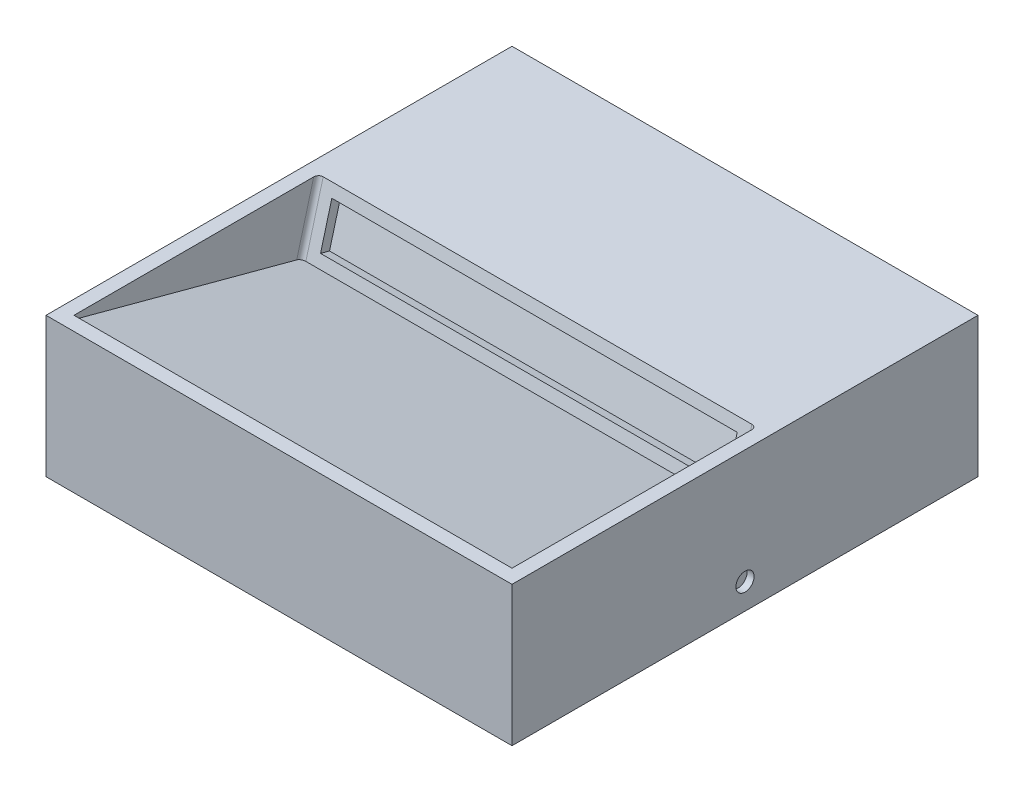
from build123d import *

# Parameters (mm, degrees)
CROQUIS1_W                          = 100
CROQUIS1_H                          = 100
SALIENTE_EXTRUIR1_DEPTH             = 30
CORTAR_EXTRUIR1_DEPTH               = 34
CROQUIS4_W                          = 87
CROQUIS4_H                          = 9.360089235
CORTAR_EXTRUIR2_DEPTH               = 2
CORTAR_EXTRUIR3_DEPTH               = 15
TALADRO_DE_MARGEN_PARA_M3_51_REACH  = 116.456
TALADRO_DE_MARGEN_PARA_M3_51_BORE_R = 1.95
SALIENTE_EXTRUIR2_REACH             = 146.568
CROQUIS11_W                         = 94
CROQUIS11_H                         = 3


with BuildPart() as part:
    # Croquis1 → Saliente-Extruir1 (new body)
    with BuildSketch(Plane(origin=(0, 0, 0), x_dir=(1, 0, 0), z_dir=(0, 1, 0))):
        with Locations((50, 50)):
            Rectangle(CROQUIS1_W, CROQUIS1_H)
    extrude(amount=SALIENTE_EXTRUIR1_DEPTH)

    # Croquis3 → Cortar-Extruir1 (cut)
    with BuildSketch(Plane(origin=(0, 27.990381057, -7.5), x_dir=(1, 0, 0), z_dir=(0, 0.9659258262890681, -0.25881904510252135))):
        with BuildLine():
            Line((4, 45.828011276), (96, 45.828011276))
            ThreePointArc((96, 45.828011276), (96.707106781, 45.535118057), (97, 44.828011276))
            Line((97, 44.828011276), (97, -7.764571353))
            Line((97, -7.764571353), (3, -7.764571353))
            Line((3, -7.764571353), (3, 44.828011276))
            ThreePointArc((3, 44.828011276), (3.292893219, 45.535118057), (4, 45.828011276))
        make_face()
    extrude(amount=CORTAR_EXTRUIR1_DEPTH, mode=Mode.SUBTRACT)

    # Croquis4 → Cortar-Extruir2 (cut)
    with BuildSketch(Plane(origin=(0, -11.861162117, -44.266459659), x_dir=(1, 0, 0), z_dir=(0, 0.2588190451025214, 0.9659258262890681))):
        with Locations((50, 36.157819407)):
            Rectangle(CROQUIS4_W, CROQUIS4_H)
    extrude(amount=-CORTAR_EXTRUIR2_DEPTH, mode=Mode.SUBTRACT)

    # Croquis5 → Cortar-Extruir3 (cut)
    with BuildSketch(Plane.XZ):
        with BuildLine():
            Line((96.5, -1.5), (3.5, -1.5))
            ThreePointArc((3.5, -1.5), (2.085786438, -2.085786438), (1.5, -3.5))
            Line((1.5, -3.5), (1.5, -96.5))
            ThreePointArc((1.5, -96.5), (2.085786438, -97.914213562), (3.5, -98.5))
            Line((3.5, -98.5), (96.5, -98.5))
            ThreePointArc((96.5, -98.5), (97.914213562, -97.914213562), (98.5, -96.5))
            Line((98.5, -96.5), (98.5, -3.5))
            ThreePointArc((98.5, -3.5), (97.914213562, -2.085786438), (96.5, -1.5))
        make_face()
        with BuildLine():
            Line((96.5, -2.5), (3.5, -2.5))
            ThreePointArc((3.5, -2.5), (2.792893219, -2.792893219), (2.5, -3.5))
            Line((2.5, -3.5), (2.5, -96.5))
            ThreePointArc((2.5, -96.5), (2.792893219, -97.207106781), (3.5, -97.5))
            Line((3.5, -97.5), (96.5, -97.5))
            ThreePointArc((96.5, -97.5), (97.207106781, -97.207106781), (97.5, -96.5))
            Line((97.5, -96.5), (97.5, -3.5))
            ThreePointArc((97.5, -3.5), (97.207106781, -2.792893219), (96.5, -2.5))
        make_face(mode=Mode.SUBTRACT)
    extrude(amount=-CORTAR_EXTRUIR3_DEPTH, mode=Mode.SUBTRACT)

    # Taladro de margen para M3.51 bore (on position points) → Taladro de margen para M3.51 (cut, up to next)
    with BuildSketch(Plane(origin=(0, 5.5, -50), x_dir=(0, 0, -1), z_dir=(-1, 0, 0)), mode=Mode.PRIVATE) as taladro_de_margen_para_m3_51_sk1:
        Circle(TALADRO_DE_MARGEN_PARA_M3_51_BORE_R)
    taladro_de_margen_para_m3_51_tool1 = extrude(taladro_de_margen_para_m3_51_sk1.sketch, amount=-TALADRO_DE_MARGEN_PARA_M3_51_REACH, mode=Mode.PRIVATE) & part.part
    taladro_de_margen_para_m3_51 = taladro_de_margen_para_m3_51_tool1.solids().sort_by_distance((0, 5.5, -50))[0]
    add(taladro_de_margen_para_m3_51, mode=Mode.SUBTRACT)

    # Simetr_a1: Taladro de margen para M3.51 across plane
    add(taladro_de_margen_para_m3_51.mirror(Plane.ZY.offset(-50)), mode=Mode.SUBTRACT)

    # Saliente-Extruir2: up to this face of the body (flat: up to its plane)
    saliente_extruir2_end = Plane(part.part.faces().sort_by_distance((50, 23.065195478, -25.881042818))[0])
    # Croquis11 → Saliente-Extruir2 (add, up to the picked face)
    with BuildSketch(Plane(origin=(0, 30, 0), x_dir=(1, 0, 0), z_dir=(0, 1, 0)), mode=Mode.PRIVATE) as saliente_extruir2_sk1:
        with Locations((50, 1.5)):
            Rectangle(CROQUIS11_W, CROQUIS11_H)
    saliente_extruir2_tool1 = split(extrude(saliente_extruir2_sk1.sketch, amount=-SALIENTE_EXTRUIR2_REACH, mode=Mode.PRIVATE), bisect_by=saliente_extruir2_end, keep=Keep.BOTH, mode=Mode.PRIVATE)
    add(saliente_extruir2_tool1.solids().sort_by(Axis((50, 30, -1.5), (0, -1, 0)))[0])


solid = part.part
